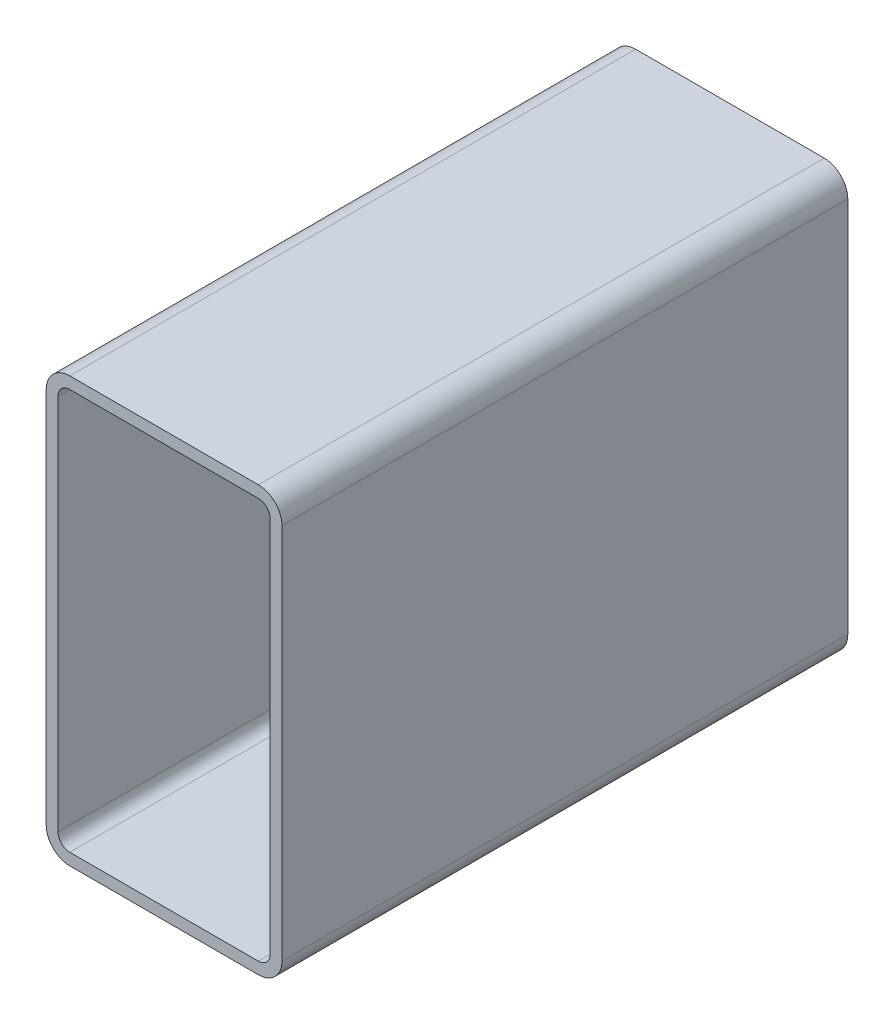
ISO-10303-21;
HEADER;
FILE_DESCRIPTION(('STEP AP214'),'2;1');
FILE_NAME('part.step','',(''),(''),'','','');
FILE_SCHEMA(('AUTOMOTIVE_DESIGN { 1 0 10303 214 1 1 1 1 }'));
ENDSEC;
DATA;
#1=APPLICATION_CONTEXT('core data for automotive mechanical design processes');
#2=APPLICATION_PROTOCOL_DEFINITION('international standard','automotive_design',2000,#1);
#3=PRODUCT_CONTEXT('',#1,'mechanical');
#4=PRODUCT('Part','Part','',(#3));
#5=PRODUCT_RELATED_PRODUCT_CATEGORY('part','',(#4));
#6=PRODUCT_DEFINITION_FORMATION('','',#4);
#7=PRODUCT_DEFINITION_CONTEXT('part definition',#1,'design');
#8=PRODUCT_DEFINITION('design','',#6,#7);
#9=PRODUCT_DEFINITION_SHAPE('','',#8);
#10=(LENGTH_UNIT() NAMED_UNIT(*) SI_UNIT(.MILLI.,.METRE.));
#11=(NAMED_UNIT(*) PLANE_ANGLE_UNIT() SI_UNIT($,.RADIAN.));
#12=(NAMED_UNIT(*) SI_UNIT($,.STERADIAN.) SOLID_ANGLE_UNIT());
#13=UNCERTAINTY_MEASURE_WITH_UNIT(LENGTH_MEASURE(1.E-05),#10,'distance_accuracy_value','');
#14=(GEOMETRIC_REPRESENTATION_CONTEXT(3) GLOBAL_UNCERTAINTY_ASSIGNED_CONTEXT((#13)) GLOBAL_UNIT_ASSIGNED_CONTEXT((#10,
#11,#12)) REPRESENTATION_CONTEXT('',''));
#15=CARTESIAN_POINT('',(0.,0.,0.));
#16=DIRECTION('',(0.,0.,1.));
#17=DIRECTION('',(1.,0.,0.));
#18=AXIS2_PLACEMENT_3D('',#15,#16,#17);
#19=CARTESIAN_POINT('',(13.5612396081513,217.843222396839,304.8));
#20=DIRECTION('',(0.,0.,1.));
#21=DIRECTION('',(1.,0.,0.));
#22=AXIS2_PLACEMENT_3D('',#19,#20,#21);
#23=PLANE('',#22);
#24=CARTESIAN_POINT('',(13.5612396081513,217.843222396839,304.8));
#25=DIRECTION('',(0.,0.,1.));
#26=DIRECTION('',(1.,0.,0.));
#27=AXIS2_PLACEMENT_3D('',#24,#25,#26);
#28=CIRCLE('',#27,12.7);
#29=CARTESIAN_POINT('',(13.5612396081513,230.543222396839,304.8));
#30=VERTEX_POINT('',#29);
#31=CARTESIAN_POINT('',(0.8612396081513,217.843222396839,304.8));
#32=VERTEX_POINT('',#31);
#33=EDGE_CURVE('E211',#30,#32,#28,.T.);
#34=ORIENTED_EDGE('',*,*,#33,.T.);
#35=DIRECTION('',(0.,-1.,0.));
#36=VECTOR('',#35,1.);
#37=CARTESIAN_POINT('',(0.8612396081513,14.6432223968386,304.8));
#38=LINE('',#37,#36);
#39=CARTESIAN_POINT('',(0.861239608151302,14.6432223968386,304.8));
#40=VERTEX_POINT('',#39);
#41=EDGE_CURVE('E214',#32,#40,#38,.T.);
#42=ORIENTED_EDGE('',*,*,#41,.T.);
#43=CARTESIAN_POINT('',(13.5612396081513,14.6432223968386,304.8));
#44=DIRECTION('',(0.,0.,1.));
#45=DIRECTION('',(1.,0.,0.));
#46=AXIS2_PLACEMENT_3D('',#43,#44,#45);
#47=CIRCLE('',#46,12.7);
#48=CARTESIAN_POINT('',(13.5612396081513,1.94322239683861,304.8));
#49=VERTEX_POINT('',#48);
#50=EDGE_CURVE('E217',#40,#49,#47,.T.);
#51=ORIENTED_EDGE('',*,*,#50,.T.);
#52=DIRECTION('',(1.,0.,0.));
#53=VECTOR('',#52,1.);
#54=CARTESIAN_POINT('',(115.161239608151,1.94322239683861,304.8));
#55=LINE('',#54,#53);
#56=CARTESIAN_POINT('',(115.161239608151,1.94322239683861,304.8));
#57=VERTEX_POINT('',#56);
#58=EDGE_CURVE('E219',#49,#57,#55,.T.);
#59=ORIENTED_EDGE('',*,*,#58,.T.);
#60=CARTESIAN_POINT('',(115.161239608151,14.6432223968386,304.8));
#61=DIRECTION('',(0.,0.,1.));
#62=DIRECTION('',(1.,0.,0.));
#63=AXIS2_PLACEMENT_3D('',#60,#61,#62);
#64=CIRCLE('',#63,12.7);
#65=CARTESIAN_POINT('',(127.861239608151,14.6432223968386,304.8));
#66=VERTEX_POINT('',#65);
#67=EDGE_CURVE('E221',#57,#66,#64,.T.);
#68=ORIENTED_EDGE('',*,*,#67,.T.);
#69=DIRECTION('',(0.,1.,0.));
#70=VECTOR('',#69,1.);
#71=CARTESIAN_POINT('',(127.861239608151,217.843222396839,304.8));
#72=LINE('',#71,#70);
#73=CARTESIAN_POINT('',(127.861239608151,217.843222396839,304.8));
#74=VERTEX_POINT('',#73);
#75=EDGE_CURVE('E223',#66,#74,#72,.T.);
#76=ORIENTED_EDGE('',*,*,#75,.T.);
#77=CARTESIAN_POINT('',(115.161239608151,217.843222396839,304.8));
#78=DIRECTION('',(0.,0.,1.));
#79=DIRECTION('',(1.,0.,0.));
#80=AXIS2_PLACEMENT_3D('',#77,#78,#79);
#81=CIRCLE('',#80,12.7);
#82=CARTESIAN_POINT('',(115.161239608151,230.543222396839,304.8));
#83=VERTEX_POINT('',#82);
#84=EDGE_CURVE('E225',#74,#83,#81,.T.);
#85=ORIENTED_EDGE('',*,*,#84,.T.);
#86=DIRECTION('',(-1.,0.,0.));
#87=VECTOR('',#86,1.);
#88=CARTESIAN_POINT('',(13.5612396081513,230.543222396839,304.8));
#89=LINE('',#88,#87);
#90=EDGE_CURVE('E227',#83,#30,#89,.T.);
#91=ORIENTED_EDGE('',*,*,#90,.T.);
#92=EDGE_LOOP('',(#34,#42,#51,#59,#68,#76,#85,#91));
#93=FACE_BOUND('',#92,.T.);
#94=DIRECTION('',(0.,-1.,0.));
#95=VECTOR('',#94,1.);
#96=CARTESIAN_POINT('',(7.2112396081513,14.6432223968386,304.8));
#97=LINE('',#96,#95);
#98=CARTESIAN_POINT('',(7.2112396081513,217.843222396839,304.8));
#99=VERTEX_POINT('',#98);
#100=CARTESIAN_POINT('',(7.2112396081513,14.6432223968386,304.8));
#101=VERTEX_POINT('',#100);
#102=EDGE_CURVE('E154',#99,#101,#97,.T.);
#103=ORIENTED_EDGE('',*,*,#102,.F.);
#104=CARTESIAN_POINT('',(13.5612396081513,217.843222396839,304.8));
#105=DIRECTION('',(0.,0.,1.));
#106=DIRECTION('',(1.,0.,0.));
#107=AXIS2_PLACEMENT_3D('',#104,#105,#106);
#108=CIRCLE('',#107,6.35);
#109=CARTESIAN_POINT('',(13.5612396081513,224.193222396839,304.8));
#110=VERTEX_POINT('',#109);
#111=EDGE_CURVE('E146',#110,#99,#108,.T.);
#112=ORIENTED_EDGE('',*,*,#111,.F.);
#113=DIRECTION('',(-1.,0.,0.));
#114=VECTOR('',#113,1.);
#115=CARTESIAN_POINT('',(13.5612396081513,224.193222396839,304.8));
#116=LINE('',#115,#114);
#117=CARTESIAN_POINT('',(115.161239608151,224.193222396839,304.8));
#118=VERTEX_POINT('',#117);
#119=EDGE_CURVE('E179',#118,#110,#116,.T.);
#120=ORIENTED_EDGE('',*,*,#119,.F.);
#121=CARTESIAN_POINT('',(115.161239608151,217.843222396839,304.8));
#122=DIRECTION('',(0.,0.,1.));
#123=DIRECTION('',(1.,0.,0.));
#124=AXIS2_PLACEMENT_3D('',#121,#122,#123);
#125=CIRCLE('',#124,6.35);
#126=CARTESIAN_POINT('',(121.511239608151,217.843222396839,304.8));
#127=VERTEX_POINT('',#126);
#128=EDGE_CURVE('E177',#127,#118,#125,.T.);
#129=ORIENTED_EDGE('',*,*,#128,.F.);
#130=DIRECTION('',(0.,1.,0.));
#131=VECTOR('',#130,1.);
#132=CARTESIAN_POINT('',(121.511239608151,217.843222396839,304.8));
#133=LINE('',#132,#131);
#134=CARTESIAN_POINT('',(121.511239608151,14.6432223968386,304.8));
#135=VERTEX_POINT('',#134);
#136=EDGE_CURVE('E175',#135,#127,#133,.T.);
#137=ORIENTED_EDGE('',*,*,#136,.F.);
#138=CARTESIAN_POINT('',(115.161239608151,14.6432223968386,304.8));
#139=DIRECTION('',(0.,0.,1.));
#140=DIRECTION('',(1.,0.,0.));
#141=AXIS2_PLACEMENT_3D('',#138,#139,#140);
#142=CIRCLE('',#141,6.35000000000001);
#143=CARTESIAN_POINT('',(115.161239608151,8.29322239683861,304.8));
#144=VERTEX_POINT('',#143);
#145=EDGE_CURVE('E173',#144,#135,#142,.T.);
#146=ORIENTED_EDGE('',*,*,#145,.F.);
#147=DIRECTION('',(1.,0.,0.));
#148=VECTOR('',#147,1.);
#149=CARTESIAN_POINT('',(115.161239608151,8.29322239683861,304.8));
#150=LINE('',#149,#148);
#151=CARTESIAN_POINT('',(13.5612396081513,8.29322239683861,304.8));
#152=VERTEX_POINT('',#151);
#153=EDGE_CURVE('E169',#152,#144,#150,.T.);
#154=ORIENTED_EDGE('',*,*,#153,.F.);
#155=CARTESIAN_POINT('',(13.5612396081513,14.6432223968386,304.8));
#156=DIRECTION('',(0.,0.,1.));
#157=DIRECTION('',(1.,0.,0.));
#158=AXIS2_PLACEMENT_3D('',#155,#156,#157);
#159=CIRCLE('',#158,6.35);
#160=EDGE_CURVE('E167',#101,#152,#159,.T.);
#161=ORIENTED_EDGE('',*,*,#160,.F.);
#162=EDGE_LOOP('',(#103,#112,#120,#129,#137,#146,#154,#161));
#163=FACE_BOUND('',#162,.T.);
#164=ADVANCED_FACE('F33',(#93,#163),#23,.T.);
#165=CARTESIAN_POINT('',(13.5612396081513,217.843222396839,0.));
#166=DIRECTION('',(0.,0.,1.));
#167=DIRECTION('',(1.,0.,0.));
#168=AXIS2_PLACEMENT_3D('',#165,#166,#167);
#169=PLANE('',#168);
#170=CARTESIAN_POINT('',(13.5612396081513,217.843222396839,0.));
#171=DIRECTION('',(0.,0.,1.));
#172=DIRECTION('',(1.,0.,0.));
#173=AXIS2_PLACEMENT_3D('',#170,#171,#172);
#174=CIRCLE('',#173,12.7);
#175=CARTESIAN_POINT('',(13.5612396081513,230.543222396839,0.));
#176=VERTEX_POINT('',#175);
#177=CARTESIAN_POINT('',(0.8612396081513,217.843222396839,0.));
#178=VERTEX_POINT('',#177);
#179=EDGE_CURVE('E162',#176,#178,#174,.T.);
#180=ORIENTED_EDGE('',*,*,#179,.F.);
#181=DIRECTION('',(-1.,0.,0.));
#182=VECTOR('',#181,1.);
#183=CARTESIAN_POINT('',(13.5612396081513,230.543222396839,0.));
#184=LINE('',#183,#182);
#185=CARTESIAN_POINT('',(115.161239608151,230.543222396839,0.));
#186=VERTEX_POINT('',#185);
#187=EDGE_CURVE('E215',#186,#176,#184,.T.);
#188=ORIENTED_EDGE('',*,*,#187,.F.);
#189=CARTESIAN_POINT('',(115.161239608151,217.843222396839,0.));
#190=DIRECTION('',(0.,0.,1.));
#191=DIRECTION('',(1.,0.,0.));
#192=AXIS2_PLACEMENT_3D('',#189,#190,#191);
#193=CIRCLE('',#192,12.7);
#194=CARTESIAN_POINT('',(127.861239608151,217.843222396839,0.));
#195=VERTEX_POINT('',#194);
#196=EDGE_CURVE('E242',#195,#186,#193,.T.);
#197=ORIENTED_EDGE('',*,*,#196,.F.);
#198=DIRECTION('',(0.,1.,0.));
#199=VECTOR('',#198,1.);
#200=CARTESIAN_POINT('',(127.861239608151,217.843222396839,0.));
#201=LINE('',#200,#199);
#202=CARTESIAN_POINT('',(127.861239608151,14.6432223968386,0.));
#203=VERTEX_POINT('',#202);
#204=EDGE_CURVE('E240',#203,#195,#201,.T.);
#205=ORIENTED_EDGE('',*,*,#204,.F.);
#206=CARTESIAN_POINT('',(115.161239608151,14.6432223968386,0.));
#207=DIRECTION('',(0.,0.,1.));
#208=DIRECTION('',(1.,0.,0.));
#209=AXIS2_PLACEMENT_3D('',#206,#207,#208);
#210=CIRCLE('',#209,12.7);
#211=CARTESIAN_POINT('',(115.161239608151,1.94322239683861,0.));
#212=VERTEX_POINT('',#211);
#213=EDGE_CURVE('E238',#212,#203,#210,.T.);
#214=ORIENTED_EDGE('',*,*,#213,.F.);
#215=DIRECTION('',(1.,0.,0.));
#216=VECTOR('',#215,1.);
#217=CARTESIAN_POINT('',(115.161239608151,1.94322239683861,0.));
#218=LINE('',#217,#216);
#219=CARTESIAN_POINT('',(13.5612396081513,1.94322239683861,0.));
#220=VERTEX_POINT('',#219);
#221=EDGE_CURVE('E236',#220,#212,#218,.T.);
#222=ORIENTED_EDGE('',*,*,#221,.F.);
#223=CARTESIAN_POINT('',(13.5612396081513,14.6432223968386,0.));
#224=DIRECTION('',(0.,0.,1.));
#225=DIRECTION('',(1.,0.,0.));
#226=AXIS2_PLACEMENT_3D('',#223,#224,#225);
#227=CIRCLE('',#226,12.7);
#228=CARTESIAN_POINT('',(0.861239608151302,14.6432223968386,0.));
#229=VERTEX_POINT('',#228);
#230=EDGE_CURVE('E234',#229,#220,#227,.T.);
#231=ORIENTED_EDGE('',*,*,#230,.F.);
#232=DIRECTION('',(0.,-1.,0.));
#233=VECTOR('',#232,1.);
#234=CARTESIAN_POINT('',(0.8612396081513,14.6432223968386,0.));
#235=LINE('',#234,#233);
#236=EDGE_CURVE('E232',#178,#229,#235,.T.);
#237=ORIENTED_EDGE('',*,*,#236,.F.);
#238=EDGE_LOOP('',(#180,#188,#197,#205,#214,#222,#231,#237));
#239=FACE_BOUND('',#238,.T.);
#240=CARTESIAN_POINT('',(13.5612396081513,217.843222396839,0.));
#241=DIRECTION('',(0.,0.,1.));
#242=DIRECTION('',(1.,0.,0.));
#243=AXIS2_PLACEMENT_3D('',#240,#241,#242);
#244=CIRCLE('',#243,6.35);
#245=CARTESIAN_POINT('',(13.5612396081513,224.193222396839,0.));
#246=VERTEX_POINT('',#245);
#247=CARTESIAN_POINT('',(7.2112396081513,217.843222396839,0.));
#248=VERTEX_POINT('',#247);
#249=EDGE_CURVE('E56',#246,#248,#244,.T.);
#250=ORIENTED_EDGE('',*,*,#249,.T.);
#251=DIRECTION('',(0.,-1.,0.));
#252=VECTOR('',#251,1.);
#253=CARTESIAN_POINT('',(7.2112396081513,14.6432223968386,0.));
#254=LINE('',#253,#252);
#255=CARTESIAN_POINT('',(7.2112396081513,14.6432223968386,0.));
#256=VERTEX_POINT('',#255);
#257=EDGE_CURVE('E161',#248,#256,#254,.T.);
#258=ORIENTED_EDGE('',*,*,#257,.T.);
#259=CARTESIAN_POINT('',(13.5612396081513,14.6432223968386,0.));
#260=DIRECTION('',(0.,0.,1.));
#261=DIRECTION('',(1.,0.,0.));
#262=AXIS2_PLACEMENT_3D('',#259,#260,#261);
#263=CIRCLE('',#262,6.35);
#264=CARTESIAN_POINT('',(13.5612396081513,8.29322239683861,0.));
#265=VERTEX_POINT('',#264);
#266=EDGE_CURVE('E183',#256,#265,#263,.T.);
#267=ORIENTED_EDGE('',*,*,#266,.T.);
#268=DIRECTION('',(1.,0.,0.));
#269=VECTOR('',#268,1.);
#270=CARTESIAN_POINT('',(115.161239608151,8.29322239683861,0.));
#271=LINE('',#270,#269);
#272=CARTESIAN_POINT('',(115.161239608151,8.29322239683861,0.));
#273=VERTEX_POINT('',#272);
#274=EDGE_CURVE('E186',#265,#273,#271,.T.);
#275=ORIENTED_EDGE('',*,*,#274,.T.);
#276=CARTESIAN_POINT('',(115.161239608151,14.6432223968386,0.));
#277=DIRECTION('',(0.,0.,1.));
#278=DIRECTION('',(1.,0.,0.));
#279=AXIS2_PLACEMENT_3D('',#276,#277,#278);
#280=CIRCLE('',#279,6.35000000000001);
#281=CARTESIAN_POINT('',(121.511239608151,14.6432223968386,0.));
#282=VERTEX_POINT('',#281);
#283=EDGE_CURVE('E189',#273,#282,#280,.T.);
#284=ORIENTED_EDGE('',*,*,#283,.T.);
#285=DIRECTION('',(0.,1.,0.));
#286=VECTOR('',#285,1.);
#287=CARTESIAN_POINT('',(121.511239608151,217.843222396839,0.));
#288=LINE('',#287,#286);
#289=CARTESIAN_POINT('',(121.511239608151,217.843222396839,0.));
#290=VERTEX_POINT('',#289);
#291=EDGE_CURVE('E192',#282,#290,#288,.T.);
#292=ORIENTED_EDGE('',*,*,#291,.T.);
#293=CARTESIAN_POINT('',(115.161239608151,217.843222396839,0.));
#294=DIRECTION('',(0.,0.,1.));
#295=DIRECTION('',(1.,0.,0.));
#296=AXIS2_PLACEMENT_3D('',#293,#294,#295);
#297=CIRCLE('',#296,6.35);
#298=CARTESIAN_POINT('',(115.161239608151,224.193222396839,0.));
#299=VERTEX_POINT('',#298);
#300=EDGE_CURVE('E195',#290,#299,#297,.T.);
#301=ORIENTED_EDGE('',*,*,#300,.T.);
#302=DIRECTION('',(-1.,0.,0.));
#303=VECTOR('',#302,1.);
#304=CARTESIAN_POINT('',(13.5612396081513,224.193222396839,0.));
#305=LINE('',#304,#303);
#306=EDGE_CURVE('E155',#299,#246,#305,.T.);
#307=ORIENTED_EDGE('',*,*,#306,.T.);
#308=EDGE_LOOP('',(#250,#258,#267,#275,#284,#292,#301,#307));
#309=FACE_BOUND('',#308,.T.);
#310=ADVANCED_FACE('F272',(#239,#309),#169,.F.);
#311=CARTESIAN_POINT('',(13.5612396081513,217.843222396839,304.8));
#312=DIRECTION('',(0.,0.,-1.));
#313=DIRECTION('',(-1.,0.,0.));
#314=AXIS2_PLACEMENT_3D('',#311,#312,#313);
#315=CYLINDRICAL_SURFACE('',#314,12.7);
#316=ORIENTED_EDGE('',*,*,#179,.T.);
#317=DIRECTION('',(0.,0.,-1.));
#318=VECTOR('',#317,1.);
#319=CARTESIAN_POINT('',(0.8612396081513,217.843222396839,304.8));
#320=LINE('',#319,#318);
#321=EDGE_CURVE('E11',#32,#178,#320,.T.);
#322=ORIENTED_EDGE('',*,*,#321,.F.);
#323=ORIENTED_EDGE('',*,*,#33,.F.);
#324=DIRECTION('',(0.,0.,-1.));
#325=VECTOR('',#324,1.);
#326=CARTESIAN_POINT('',(13.5612396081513,230.543222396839,304.8));
#327=LINE('',#326,#325);
#328=EDGE_CURVE('E229',#30,#176,#327,.T.);
#329=ORIENTED_EDGE('',*,*,#328,.T.);
#330=EDGE_LOOP('',(#316,#322,#323,#329));
#331=FACE_BOUND('',#330,.T.);
#332=ADVANCED_FACE('F35',(#331),#315,.T.);
#333=CARTESIAN_POINT('',(0.8612396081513,14.6432223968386,304.8));
#334=DIRECTION('',(1.,0.,0.));
#335=DIRECTION('',(0.,0.,-1.));
#336=AXIS2_PLACEMENT_3D('',#333,#334,#335);
#337=PLANE('',#336);
#338=ORIENTED_EDGE('',*,*,#236,.T.);
#339=DIRECTION('',(0.,0.,-1.));
#340=VECTOR('',#339,1.);
#341=CARTESIAN_POINT('',(0.861239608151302,14.6432223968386,304.8));
#342=LINE('',#341,#340);
#343=EDGE_CURVE('E41',#40,#229,#342,.T.);
#344=ORIENTED_EDGE('',*,*,#343,.F.);
#345=ORIENTED_EDGE('',*,*,#41,.F.);
#346=ORIENTED_EDGE('',*,*,#321,.T.);
#347=EDGE_LOOP('',(#338,#344,#345,#346));
#348=FACE_BOUND('',#347,.T.);
#349=ADVANCED_FACE('F289',(#348),#337,.F.);
#350=CARTESIAN_POINT('',(13.5612396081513,14.6432223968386,304.8));
#351=DIRECTION('',(0.,0.,-1.));
#352=DIRECTION('',(-1.,0.,0.));
#353=AXIS2_PLACEMENT_3D('',#350,#351,#352);
#354=CYLINDRICAL_SURFACE('',#353,12.7);
#355=ORIENTED_EDGE('',*,*,#230,.T.);
#356=DIRECTION('',(0.,0.,-1.));
#357=VECTOR('',#356,1.);
#358=CARTESIAN_POINT('',(13.5612396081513,1.94322239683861,304.8));
#359=LINE('',#358,#357);
#360=EDGE_CURVE('E259',#49,#220,#359,.T.);
#361=ORIENTED_EDGE('',*,*,#360,.F.);
#362=ORIENTED_EDGE('',*,*,#50,.F.);
#363=ORIENTED_EDGE('',*,*,#343,.T.);
#364=EDGE_LOOP('',(#355,#361,#362,#363));
#365=FACE_BOUND('',#364,.T.);
#366=ADVANCED_FACE('F266',(#365),#354,.T.);
#367=CARTESIAN_POINT('',(115.161239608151,1.94322239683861,304.8));
#368=DIRECTION('',(0.,1.,0.));
#369=DIRECTION('',(0.,0.,1.));
#370=AXIS2_PLACEMENT_3D('',#367,#368,#369);
#371=PLANE('',#370);
#372=ORIENTED_EDGE('',*,*,#221,.T.);
#373=DIRECTION('',(0.,0.,-1.));
#374=VECTOR('',#373,1.);
#375=CARTESIAN_POINT('',(115.161239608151,1.94322239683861,304.8));
#376=LINE('',#375,#374);
#377=EDGE_CURVE('E256',#57,#212,#376,.T.);
#378=ORIENTED_EDGE('',*,*,#377,.F.);
#379=ORIENTED_EDGE('',*,*,#58,.F.);
#380=ORIENTED_EDGE('',*,*,#360,.T.);
#381=EDGE_LOOP('',(#372,#378,#379,#380));
#382=FACE_BOUND('',#381,.T.);
#383=ADVANCED_FACE('F278',(#382),#371,.F.);
#384=CARTESIAN_POINT('',(115.161239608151,14.6432223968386,304.8));
#385=DIRECTION('',(0.,0.,-1.));
#386=DIRECTION('',(-1.,0.,0.));
#387=AXIS2_PLACEMENT_3D('',#384,#385,#386);
#388=CYLINDRICAL_SURFACE('',#387,12.7);
#389=ORIENTED_EDGE('',*,*,#213,.T.);
#390=DIRECTION('',(0.,0.,-1.));
#391=VECTOR('',#390,1.);
#392=CARTESIAN_POINT('',(127.861239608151,14.6432223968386,304.8));
#393=LINE('',#392,#391);
#394=EDGE_CURVE('E253',#66,#203,#393,.T.);
#395=ORIENTED_EDGE('',*,*,#394,.F.);
#396=ORIENTED_EDGE('',*,*,#67,.F.);
#397=ORIENTED_EDGE('',*,*,#377,.T.);
#398=EDGE_LOOP('',(#389,#395,#396,#397));
#399=FACE_BOUND('',#398,.T.);
#400=ADVANCED_FACE('F282',(#399),#388,.T.);
#401=CARTESIAN_POINT('',(127.861239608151,217.843222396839,304.8));
#402=DIRECTION('',(-1.,0.,0.));
#403=DIRECTION('',(0.,0.,1.));
#404=AXIS2_PLACEMENT_3D('',#401,#402,#403);
#405=PLANE('',#404);
#406=ORIENTED_EDGE('',*,*,#204,.T.);
#407=DIRECTION('',(0.,0.,-1.));
#408=VECTOR('',#407,1.);
#409=CARTESIAN_POINT('',(127.861239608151,217.843222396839,304.8));
#410=LINE('',#409,#408);
#411=EDGE_CURVE('E250',#74,#195,#410,.T.);
#412=ORIENTED_EDGE('',*,*,#411,.F.);
#413=ORIENTED_EDGE('',*,*,#75,.F.);
#414=ORIENTED_EDGE('',*,*,#394,.T.);
#415=EDGE_LOOP('',(#406,#412,#413,#414));
#416=FACE_BOUND('',#415,.T.);
#417=ADVANCED_FACE('F302',(#416),#405,.F.);
#418=CARTESIAN_POINT('',(115.161239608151,217.843222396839,304.8));
#419=DIRECTION('',(0.,0.,-1.));
#420=DIRECTION('',(-1.,0.,0.));
#421=AXIS2_PLACEMENT_3D('',#418,#419,#420);
#422=CYLINDRICAL_SURFACE('',#421,12.7);
#423=ORIENTED_EDGE('',*,*,#196,.T.);
#424=DIRECTION('',(0.,0.,-1.));
#425=VECTOR('',#424,1.);
#426=CARTESIAN_POINT('',(115.161239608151,230.543222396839,304.8));
#427=LINE('',#426,#425);
#428=EDGE_CURVE('E247',#83,#186,#427,.T.);
#429=ORIENTED_EDGE('',*,*,#428,.F.);
#430=ORIENTED_EDGE('',*,*,#84,.F.);
#431=ORIENTED_EDGE('',*,*,#411,.T.);
#432=EDGE_LOOP('',(#423,#429,#430,#431));
#433=FACE_BOUND('',#432,.T.);
#434=ADVANCED_FACE('F300',(#433),#422,.T.);
#435=CARTESIAN_POINT('',(13.5612396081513,230.543222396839,304.8));
#436=DIRECTION('',(0.,-1.,0.));
#437=DIRECTION('',(0.,0.,-1.));
#438=AXIS2_PLACEMENT_3D('',#435,#436,#437);
#439=PLANE('',#438);
#440=ORIENTED_EDGE('',*,*,#187,.T.);
#441=ORIENTED_EDGE('',*,*,#328,.F.);
#442=ORIENTED_EDGE('',*,*,#90,.F.);
#443=ORIENTED_EDGE('',*,*,#428,.T.);
#444=EDGE_LOOP('',(#440,#441,#442,#443));
#445=FACE_BOUND('',#444,.T.);
#446=ADVANCED_FACE('F295',(#445),#439,.F.);
#447=CARTESIAN_POINT('',(13.5612396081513,217.843222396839,304.8));
#448=DIRECTION('',(0.,0.,-1.));
#449=DIRECTION('',(-1.,0.,0.));
#450=AXIS2_PLACEMENT_3D('',#447,#448,#449);
#451=CYLINDRICAL_SURFACE('',#450,6.35);
#452=ORIENTED_EDGE('',*,*,#249,.F.);
#453=DIRECTION('',(0.,0.,-1.));
#454=VECTOR('',#453,1.);
#455=CARTESIAN_POINT('',(13.5612396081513,224.193222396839,304.8));
#456=LINE('',#455,#454);
#457=EDGE_CURVE('E150',#110,#246,#456,.T.);
#458=ORIENTED_EDGE('',*,*,#457,.F.);
#459=ORIENTED_EDGE('',*,*,#111,.T.);
#460=DIRECTION('',(0.,0.,-1.));
#461=VECTOR('',#460,1.);
#462=CARTESIAN_POINT('',(7.2112396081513,217.843222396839,304.8));
#463=LINE('',#462,#461);
#464=EDGE_CURVE('E149',#99,#248,#463,.T.);
#465=ORIENTED_EDGE('',*,*,#464,.T.);
#466=EDGE_LOOP('',(#452,#458,#459,#465));
#467=FACE_BOUND('',#466,.T.);
#468=ADVANCED_FACE('F148',(#467),#451,.F.);
#469=CARTESIAN_POINT('',(7.2112396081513,14.6432223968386,304.8));
#470=DIRECTION('',(1.,0.,0.));
#471=DIRECTION('',(0.,0.,-1.));
#472=AXIS2_PLACEMENT_3D('',#469,#470,#471);
#473=PLANE('',#472);
#474=ORIENTED_EDGE('',*,*,#257,.F.);
#475=ORIENTED_EDGE('',*,*,#464,.F.);
#476=ORIENTED_EDGE('',*,*,#102,.T.);
#477=DIRECTION('',(0.,0.,-1.));
#478=VECTOR('',#477,1.);
#479=CARTESIAN_POINT('',(7.2112396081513,14.6432223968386,304.8));
#480=LINE('',#479,#478);
#481=EDGE_CURVE('E163',#101,#256,#480,.T.);
#482=ORIENTED_EDGE('',*,*,#481,.T.);
#483=EDGE_LOOP('',(#474,#475,#476,#482));
#484=FACE_BOUND('',#483,.T.);
#485=ADVANCED_FACE('F158',(#484),#473,.T.);
#486=CARTESIAN_POINT('',(13.5612396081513,14.6432223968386,304.8));
#487=DIRECTION('',(0.,0.,-1.));
#488=DIRECTION('',(-1.,0.,0.));
#489=AXIS2_PLACEMENT_3D('',#486,#487,#488);
#490=CYLINDRICAL_SURFACE('',#489,6.35);
#491=ORIENTED_EDGE('',*,*,#266,.F.);
#492=ORIENTED_EDGE('',*,*,#481,.F.);
#493=ORIENTED_EDGE('',*,*,#160,.T.);
#494=DIRECTION('',(0.,0.,-1.));
#495=VECTOR('',#494,1.);
#496=CARTESIAN_POINT('',(13.5612396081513,8.29322239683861,304.8));
#497=LINE('',#496,#495);
#498=EDGE_CURVE('E208',#152,#265,#497,.T.);
#499=ORIENTED_EDGE('',*,*,#498,.T.);
#500=EDGE_LOOP('',(#491,#492,#493,#499));
#501=FACE_BOUND('',#500,.T.);
#502=ADVANCED_FACE('F327',(#501),#490,.F.);
#503=CARTESIAN_POINT('',(115.161239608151,8.29322239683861,304.8));
#504=DIRECTION('',(0.,1.,0.));
#505=DIRECTION('',(0.,0.,1.));
#506=AXIS2_PLACEMENT_3D('',#503,#504,#505);
#507=PLANE('',#506);
#508=ORIENTED_EDGE('',*,*,#274,.F.);
#509=ORIENTED_EDGE('',*,*,#498,.F.);
#510=ORIENTED_EDGE('',*,*,#153,.T.);
#511=DIRECTION('',(0.,0.,-1.));
#512=VECTOR('',#511,1.);
#513=CARTESIAN_POINT('',(115.161239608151,8.29322239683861,304.8));
#514=LINE('',#513,#512);
#515=EDGE_CURVE('E206',#144,#273,#514,.T.);
#516=ORIENTED_EDGE('',*,*,#515,.T.);
#517=EDGE_LOOP('',(#508,#509,#510,#516));
#518=FACE_BOUND('',#517,.T.);
#519=ADVANCED_FACE('F331',(#518),#507,.T.);
#520=CARTESIAN_POINT('',(115.161239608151,14.6432223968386,304.8));
#521=DIRECTION('',(0.,0.,-1.));
#522=DIRECTION('',(-1.,0.,0.));
#523=AXIS2_PLACEMENT_3D('',#520,#521,#522);
#524=CYLINDRICAL_SURFACE('',#523,6.35000000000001);
#525=ORIENTED_EDGE('',*,*,#283,.F.);
#526=ORIENTED_EDGE('',*,*,#515,.F.);
#527=ORIENTED_EDGE('',*,*,#145,.T.);
#528=DIRECTION('',(0.,0.,-1.));
#529=VECTOR('',#528,1.);
#530=CARTESIAN_POINT('',(121.511239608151,14.6432223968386,304.8));
#531=LINE('',#530,#529);
#532=EDGE_CURVE('E204',#135,#282,#531,.T.);
#533=ORIENTED_EDGE('',*,*,#532,.T.);
#534=EDGE_LOOP('',(#525,#526,#527,#533));
#535=FACE_BOUND('',#534,.T.);
#536=ADVANCED_FACE('F337',(#535),#524,.F.);
#537=CARTESIAN_POINT('',(121.511239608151,217.843222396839,304.8));
#538=DIRECTION('',(-1.,0.,0.));
#539=DIRECTION('',(0.,0.,1.));
#540=AXIS2_PLACEMENT_3D('',#537,#538,#539);
#541=PLANE('',#540);
#542=ORIENTED_EDGE('',*,*,#291,.F.);
#543=ORIENTED_EDGE('',*,*,#532,.F.);
#544=ORIENTED_EDGE('',*,*,#136,.T.);
#545=DIRECTION('',(0.,0.,-1.));
#546=VECTOR('',#545,1.);
#547=CARTESIAN_POINT('',(121.511239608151,217.843222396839,304.8));
#548=LINE('',#547,#546);
#549=EDGE_CURVE('E202',#127,#290,#548,.T.);
#550=ORIENTED_EDGE('',*,*,#549,.T.);
#551=EDGE_LOOP('',(#542,#543,#544,#550));
#552=FACE_BOUND('',#551,.T.);
#553=ADVANCED_FACE('F341',(#552),#541,.T.);
#554=CARTESIAN_POINT('',(115.161239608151,217.843222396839,304.8));
#555=DIRECTION('',(0.,0.,-1.));
#556=DIRECTION('',(-1.,0.,0.));
#557=AXIS2_PLACEMENT_3D('',#554,#555,#556);
#558=CYLINDRICAL_SURFACE('',#557,6.35);
#559=ORIENTED_EDGE('',*,*,#300,.F.);
#560=ORIENTED_EDGE('',*,*,#549,.F.);
#561=ORIENTED_EDGE('',*,*,#128,.T.);
#562=DIRECTION('',(0.,0.,-1.));
#563=VECTOR('',#562,1.);
#564=CARTESIAN_POINT('',(115.161239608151,224.193222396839,304.8));
#565=LINE('',#564,#563);
#566=EDGE_CURVE('E48',#118,#299,#565,.T.);
#567=ORIENTED_EDGE('',*,*,#566,.T.);
#568=EDGE_LOOP('',(#559,#560,#561,#567));
#569=FACE_BOUND('',#568,.T.);
#570=ADVANCED_FACE('F345',(#569),#558,.F.);
#571=CARTESIAN_POINT('',(13.5612396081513,224.193222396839,304.8));
#572=DIRECTION('',(0.,-1.,0.));
#573=DIRECTION('',(0.,0.,-1.));
#574=AXIS2_PLACEMENT_3D('',#571,#572,#573);
#575=PLANE('',#574);
#576=ORIENTED_EDGE('',*,*,#306,.F.);
#577=ORIENTED_EDGE('',*,*,#566,.F.);
#578=ORIENTED_EDGE('',*,*,#119,.T.);
#579=ORIENTED_EDGE('',*,*,#457,.T.);
#580=EDGE_LOOP('',(#576,#577,#578,#579));
#581=FACE_BOUND('',#580,.T.);
#582=ADVANCED_FACE('F349',(#581),#575,.T.);
#583=CLOSED_SHELL('',(#164,#310,#332,#349,#366,#383,#400,#417,#434,#446,#468,#485,#502,#519,
#536,#553,#570,#582));
#584=MANIFOLD_SOLID_BREP('B2',#583);
#585=ADVANCED_BREP_SHAPE_REPRESENTATION('',(#18,#584),#14);
#586=SHAPE_DEFINITION_REPRESENTATION(#9,#585);
ENDSEC;
END-ISO-10303-21;
